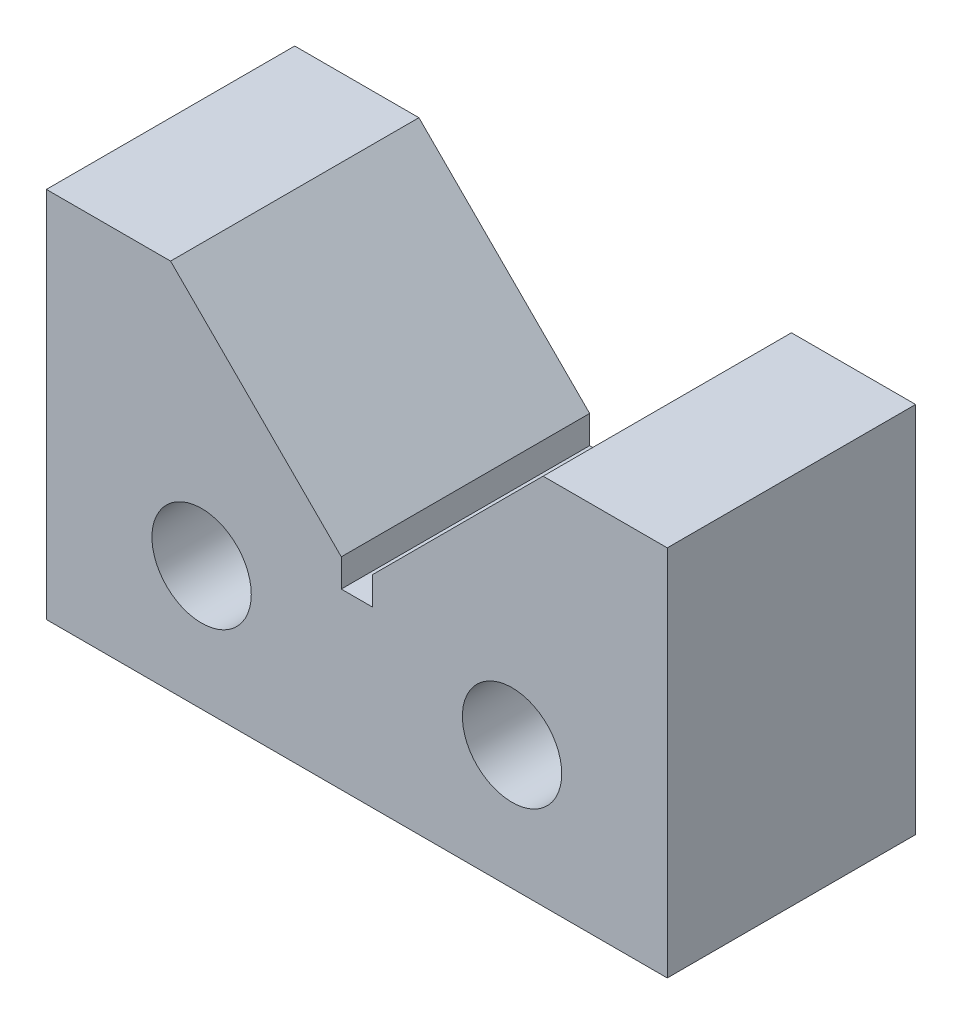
ISO-10303-21;
HEADER;
FILE_DESCRIPTION(('STEP AP214'),'2;1');
FILE_NAME('part.step','',(''),(''),'','','');
FILE_SCHEMA(('AUTOMOTIVE_DESIGN { 1 0 10303 214 1 1 1 1 }'));
ENDSEC;
DATA;
#1=APPLICATION_CONTEXT('core data for automotive mechanical design processes');
#2=APPLICATION_PROTOCOL_DEFINITION('international standard','automotive_design',2000,#1);
#3=PRODUCT_CONTEXT('',#1,'mechanical');
#4=PRODUCT('Part','Part','',(#3));
#5=PRODUCT_RELATED_PRODUCT_CATEGORY('part','',(#4));
#6=PRODUCT_DEFINITION_FORMATION('','',#4);
#7=PRODUCT_DEFINITION_CONTEXT('part definition',#1,'design');
#8=PRODUCT_DEFINITION('design','',#6,#7);
#9=PRODUCT_DEFINITION_SHAPE('','',#8);
#10=(LENGTH_UNIT() NAMED_UNIT(*) SI_UNIT(.MILLI.,.METRE.));
#11=(NAMED_UNIT(*) PLANE_ANGLE_UNIT() SI_UNIT($,.RADIAN.));
#12=(NAMED_UNIT(*) SI_UNIT($,.STERADIAN.) SOLID_ANGLE_UNIT());
#13=UNCERTAINTY_MEASURE_WITH_UNIT(LENGTH_MEASURE(1.E-05),#10,'distance_accuracy_value','');
#14=(GEOMETRIC_REPRESENTATION_CONTEXT(3) GLOBAL_UNCERTAINTY_ASSIGNED_CONTEXT((#13)) GLOBAL_UNIT_ASSIGNED_CONTEXT((#10,
#11,#12)) REPRESENTATION_CONTEXT('',''));
#15=CARTESIAN_POINT('',(0.,0.,0.));
#16=DIRECTION('',(0.,0.,1.));
#17=DIRECTION('',(1.,0.,0.));
#18=AXIS2_PLACEMENT_3D('',#15,#16,#17);
#19=CARTESIAN_POINT('',(-50.,60.,40.));
#20=DIRECTION('',(0.,-1.,0.));
#21=DIRECTION('',(0.,0.,-1.));
#22=AXIS2_PLACEMENT_3D('',#19,#20,#21);
#23=PLANE('',#22);
#24=DIRECTION('',(-1.,0.,0.));
#25=VECTOR('',#24,1.);
#26=CARTESIAN_POINT('',(-50.,60.,0.));
#27=LINE('',#26,#25);
#28=CARTESIAN_POINT('',(50.,60.,0.));
#29=VERTEX_POINT('',#28);
#30=CARTESIAN_POINT('',(30.,60.,0.));
#31=VERTEX_POINT('',#30);
#32=EDGE_CURVE('E171',#29,#31,#27,.T.);
#33=ORIENTED_EDGE('',*,*,#32,.T.);
#34=DIRECTION('',(0.,0.,1.));
#35=VECTOR('',#34,1.);
#36=CARTESIAN_POINT('',(30.,60.,0.));
#37=LINE('',#36,#35);
#38=CARTESIAN_POINT('',(30.,60.,40.));
#39=VERTEX_POINT('',#38);
#40=EDGE_CURVE('E160',#31,#39,#37,.T.);
#41=ORIENTED_EDGE('',*,*,#40,.T.);
#42=DIRECTION('',(-1.,0.,0.));
#43=VECTOR('',#42,1.);
#44=CARTESIAN_POINT('',(-50.,60.,40.));
#45=LINE('',#44,#43);
#46=CARTESIAN_POINT('',(50.,60.,40.));
#47=VERTEX_POINT('',#46);
#48=EDGE_CURVE('E175',#47,#39,#45,.T.);
#49=ORIENTED_EDGE('',*,*,#48,.F.);
#50=DIRECTION('',(0.,0.,-1.));
#51=VECTOR('',#50,1.);
#52=CARTESIAN_POINT('',(50.,60.,40.));
#53=LINE('',#52,#51);
#54=EDGE_CURVE('E188',#47,#29,#53,.T.);
#55=ORIENTED_EDGE('',*,*,#54,.T.);
#56=EDGE_LOOP('',(#33,#41,#49,#55));
#57=FACE_BOUND('',#56,.T.);
#58=ADVANCED_FACE('F31',(#57),#23,.F.);
#59=CARTESIAN_POINT('',(-50.,60.,40.));
#60=DIRECTION('',(1.,0.,0.));
#61=DIRECTION('',(0.,1.,0.));
#62=AXIS2_PLACEMENT_3D('',#59,#60,#61);
#63=PLANE('',#62);
#64=DIRECTION('',(0.,-1.,0.));
#65=VECTOR('',#64,1.);
#66=CARTESIAN_POINT('',(-50.,60.,0.));
#67=LINE('',#66,#65);
#68=CARTESIAN_POINT('',(-50.,60.,0.));
#69=VERTEX_POINT('',#68);
#70=CARTESIAN_POINT('',(-50.,0.,0.));
#71=VERTEX_POINT('',#70);
#72=EDGE_CURVE('E166',#69,#71,#67,.T.);
#73=ORIENTED_EDGE('',*,*,#72,.T.);
#74=DIRECTION('',(0.,0.,-1.));
#75=VECTOR('',#74,1.);
#76=CARTESIAN_POINT('',(-50.,0.,40.));
#77=LINE('',#76,#75);
#78=CARTESIAN_POINT('',(-50.,0.,40.));
#79=VERTEX_POINT('',#78);
#80=EDGE_CURVE('E11',#79,#71,#77,.T.);
#81=ORIENTED_EDGE('',*,*,#80,.F.);
#82=DIRECTION('',(0.,-1.,0.));
#83=VECTOR('',#82,1.);
#84=CARTESIAN_POINT('',(-50.,60.,40.));
#85=LINE('',#84,#83);
#86=CARTESIAN_POINT('',(-50.,60.,40.));
#87=VERTEX_POINT('',#86);
#88=EDGE_CURVE('E169',#87,#79,#85,.T.);
#89=ORIENTED_EDGE('',*,*,#88,.F.);
#90=DIRECTION('',(0.,0.,-1.));
#91=VECTOR('',#90,1.);
#92=CARTESIAN_POINT('',(-50.,60.,40.));
#93=LINE('',#92,#91);
#94=EDGE_CURVE('E178',#87,#69,#93,.T.);
#95=ORIENTED_EDGE('',*,*,#94,.T.);
#96=EDGE_LOOP('',(#73,#81,#89,#95));
#97=FACE_BOUND('',#96,.T.);
#98=ADVANCED_FACE('F33',(#97),#63,.F.);
#99=CARTESIAN_POINT('',(-50.,0.,40.));
#100=DIRECTION('',(0.,1.,0.));
#101=DIRECTION('',(0.,0.,1.));
#102=AXIS2_PLACEMENT_3D('',#99,#100,#101);
#103=PLANE('',#102);
#104=DIRECTION('',(1.,0.,0.));
#105=VECTOR('',#104,1.);
#106=CARTESIAN_POINT('',(-50.,0.,0.));
#107=LINE('',#106,#105);
#108=CARTESIAN_POINT('',(50.,0.,0.));
#109=VERTEX_POINT('',#108);
#110=EDGE_CURVE('E181',#71,#109,#107,.T.);
#111=ORIENTED_EDGE('',*,*,#110,.T.);
#112=DIRECTION('',(0.,0.,-1.));
#113=VECTOR('',#112,1.);
#114=CARTESIAN_POINT('',(50.,0.,40.));
#115=LINE('',#114,#113);
#116=CARTESIAN_POINT('',(50.,0.,40.));
#117=VERTEX_POINT('',#116);
#118=EDGE_CURVE('E39',#117,#109,#115,.T.);
#119=ORIENTED_EDGE('',*,*,#118,.F.);
#120=DIRECTION('',(1.,0.,0.));
#121=VECTOR('',#120,1.);
#122=CARTESIAN_POINT('',(-50.,0.,40.));
#123=LINE('',#122,#121);
#124=EDGE_CURVE('E84',#79,#117,#123,.T.);
#125=ORIENTED_EDGE('',*,*,#124,.F.);
#126=ORIENTED_EDGE('',*,*,#80,.T.);
#127=EDGE_LOOP('',(#111,#119,#125,#126));
#128=FACE_BOUND('',#127,.T.);
#129=ADVANCED_FACE('F208',(#128),#103,.F.);
#130=CARTESIAN_POINT('',(50.,60.,40.));
#131=DIRECTION('',(-1.,0.,0.));
#132=DIRECTION('',(0.,-1.,0.));
#133=AXIS2_PLACEMENT_3D('',#130,#131,#132);
#134=PLANE('',#133);
#135=DIRECTION('',(0.,1.,0.));
#136=VECTOR('',#135,1.);
#137=CARTESIAN_POINT('',(50.,60.,0.));
#138=LINE('',#137,#136);
#139=EDGE_CURVE('E183',#109,#29,#138,.T.);
#140=ORIENTED_EDGE('',*,*,#139,.T.);
#141=ORIENTED_EDGE('',*,*,#54,.F.);
#142=DIRECTION('',(0.,1.,0.));
#143=VECTOR('',#142,1.);
#144=CARTESIAN_POINT('',(50.,60.,40.));
#145=LINE('',#144,#143);
#146=EDGE_CURVE('E173',#117,#47,#145,.T.);
#147=ORIENTED_EDGE('',*,*,#146,.F.);
#148=ORIENTED_EDGE('',*,*,#118,.T.);
#149=EDGE_LOOP('',(#140,#141,#147,#148));
#150=FACE_BOUND('',#149,.T.);
#151=ADVANCED_FACE('F194',(#150),#134,.F.);
#152=CARTESIAN_POINT('',(-30.,60.,40.));
#153=VERTEX_POINT('',#152);
#154=EDGE_CURVE('E55',#153,#87,#45,.T.);
#155=ORIENTED_EDGE('',*,*,#154,.F.);
#156=DIRECTION('',(0.,0.,1.));
#157=VECTOR('',#156,1.);
#158=CARTESIAN_POINT('',(-30.,60.,0.));
#159=LINE('',#158,#157);
#160=CARTESIAN_POINT('',(-30.,60.,0.));
#161=VERTEX_POINT('',#160);
#162=EDGE_CURVE('E164',#161,#153,#159,.T.);
#163=ORIENTED_EDGE('',*,*,#162,.F.);
#164=EDGE_CURVE('E77',#161,#69,#27,.T.);
#165=ORIENTED_EDGE('',*,*,#164,.T.);
#166=ORIENTED_EDGE('',*,*,#94,.F.);
#167=EDGE_LOOP('',(#155,#163,#165,#166));
#168=FACE_BOUND('',#167,.T.);
#169=ADVANCED_FACE('F214',(#168),#23,.F.);
#170=CARTESIAN_POINT('',(-50.,0.,40.));
#171=DIRECTION('',(0.,0.,1.));
#172=DIRECTION('',(1.,0.,0.));
#173=AXIS2_PLACEMENT_3D('',#170,#171,#172);
#174=PLANE('',#173);
#175=CARTESIAN_POINT('',(25.,20.,40.));
#176=DIRECTION('',(0.,0.,1.));
#177=DIRECTION('',(1.,0.,0.));
#178=AXIS2_PLACEMENT_3D('',#175,#176,#177);
#179=CIRCLE('',#178,8.);
#180=CARTESIAN_POINT('',(33.,20.,40.));
#181=VERTEX_POINT('',#180);
#182=EDGE_CURVE('E263',#181,#181,#179,.T.);
#183=ORIENTED_EDGE('',*,*,#182,.F.);
#184=EDGE_LOOP('',(#183));
#185=FACE_BOUND('',#184,.T.);
#186=CARTESIAN_POINT('',(-25.,20.,40.));
#187=DIRECTION('',(0.,0.,1.));
#188=DIRECTION('',(1.,0.,0.));
#189=AXIS2_PLACEMENT_3D('',#186,#187,#188);
#190=CIRCLE('',#189,8.);
#191=CARTESIAN_POINT('',(-17.,20.,40.));
#192=VERTEX_POINT('',#191);
#193=EDGE_CURVE('E142',#192,#192,#190,.T.);
#194=ORIENTED_EDGE('',*,*,#193,.F.);
#195=EDGE_LOOP('',(#194));
#196=FACE_BOUND('',#195,.T.);
#197=DIRECTION('',(0.,-1.,0.));
#198=VECTOR('',#197,1.);
#199=CARTESIAN_POINT('',(-2.50000000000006,28.,40.));
#200=LINE('',#199,#198);
#201=CARTESIAN_POINT('',(-2.50000000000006,32.5000000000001,40.));
#202=VERTEX_POINT('',#201);
#203=CARTESIAN_POINT('',(-2.50000000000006,28.,40.));
#204=VERTEX_POINT('',#203);
#205=EDGE_CURVE('E120',#202,#204,#200,.T.);
#206=ORIENTED_EDGE('',*,*,#205,.F.);
#207=DIRECTION('',(0.707106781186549,-0.707106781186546,0.));
#208=VECTOR('',#207,1.);
#209=CARTESIAN_POINT('',(-30.,60.,40.));
#210=LINE('',#209,#208);
#211=EDGE_CURVE('E158',#153,#202,#210,.T.);
#212=ORIENTED_EDGE('',*,*,#211,.F.);
#213=ORIENTED_EDGE('',*,*,#154,.T.);
#214=ORIENTED_EDGE('',*,*,#88,.T.);
#215=ORIENTED_EDGE('',*,*,#124,.T.);
#216=ORIENTED_EDGE('',*,*,#146,.T.);
#217=ORIENTED_EDGE('',*,*,#48,.T.);
#218=DIRECTION('',(0.707106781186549,0.707106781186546,0.));
#219=VECTOR('',#218,1.);
#220=CARTESIAN_POINT('',(30.,60.,40.));
#221=LINE('',#220,#219);
#222=CARTESIAN_POINT('',(2.49999999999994,32.5000000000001,40.));
#223=VERTEX_POINT('',#222);
#224=EDGE_CURVE('E151',#223,#39,#221,.T.);
#225=ORIENTED_EDGE('',*,*,#224,.F.);
#226=DIRECTION('',(0.,1.,0.));
#227=VECTOR('',#226,1.);
#228=CARTESIAN_POINT('',(2.49999999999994,32.5000000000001,40.));
#229=LINE('',#228,#227);
#230=CARTESIAN_POINT('',(2.49999999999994,28.,40.));
#231=VERTEX_POINT('',#230);
#232=EDGE_CURVE('E137',#231,#223,#229,.T.);
#233=ORIENTED_EDGE('',*,*,#232,.F.);
#234=DIRECTION('',(1.,0.,0.));
#235=VECTOR('',#234,1.);
#236=CARTESIAN_POINT('',(2.49999999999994,28.,40.));
#237=LINE('',#236,#235);
#238=EDGE_CURVE('E139',#204,#231,#237,.T.);
#239=ORIENTED_EDGE('',*,*,#238,.F.);
#240=EDGE_LOOP('',(#206,#212,#213,#214,#215,#216,#217,#225,#233,#239));
#241=FACE_BOUND('',#240,.T.);
#242=ADVANCED_FACE('F203',(#185,#196,#241),#174,.T.);
#243=CARTESIAN_POINT('',(-50.,0.,0.));
#244=DIRECTION('',(0.,0.,1.));
#245=DIRECTION('',(1.,0.,0.));
#246=AXIS2_PLACEMENT_3D('',#243,#244,#245);
#247=PLANE('',#246);
#248=CARTESIAN_POINT('',(25.,20.,0.));
#249=DIRECTION('',(0.,0.,1.));
#250=DIRECTION('',(1.,0.,0.));
#251=AXIS2_PLACEMENT_3D('',#248,#249,#250);
#252=CIRCLE('',#251,8.);
#253=CARTESIAN_POINT('',(33.,20.,0.));
#254=VERTEX_POINT('',#253);
#255=EDGE_CURVE('E260',#254,#254,#252,.T.);
#256=ORIENTED_EDGE('',*,*,#255,.T.);
#257=EDGE_LOOP('',(#256));
#258=FACE_BOUND('',#257,.T.);
#259=CARTESIAN_POINT('',(-25.,20.,0.));
#260=DIRECTION('',(0.,0.,1.));
#261=DIRECTION('',(1.,0.,0.));
#262=AXIS2_PLACEMENT_3D('',#259,#260,#261);
#263=CIRCLE('',#262,8.);
#264=CARTESIAN_POINT('',(-17.,20.,0.));
#265=VERTEX_POINT('',#264);
#266=EDGE_CURVE('E147',#265,#265,#263,.T.);
#267=ORIENTED_EDGE('',*,*,#266,.T.);
#268=EDGE_LOOP('',(#267));
#269=FACE_BOUND('',#268,.T.);
#270=DIRECTION('',(0.707106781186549,-0.707106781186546,0.));
#271=VECTOR('',#270,1.);
#272=CARTESIAN_POINT('',(-30.,60.,0.));
#273=LINE('',#272,#271);
#274=CARTESIAN_POINT('',(-2.49999999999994,32.5000000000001,0.));
#275=VERTEX_POINT('',#274);
#276=EDGE_CURVE('E136',#161,#275,#273,.T.);
#277=ORIENTED_EDGE('',*,*,#276,.T.);
#278=DIRECTION('',(0.,-1.,0.));
#279=VECTOR('',#278,1.);
#280=CARTESIAN_POINT('',(-2.50000000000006,28.,0.));
#281=LINE('',#280,#279);
#282=CARTESIAN_POINT('',(-2.50000000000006,28.,0.));
#283=VERTEX_POINT('',#282);
#284=EDGE_CURVE('E46',#275,#283,#281,.T.);
#285=ORIENTED_EDGE('',*,*,#284,.T.);
#286=DIRECTION('',(1.,0.,0.));
#287=VECTOR('',#286,1.);
#288=CARTESIAN_POINT('',(2.49999999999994,28.,0.));
#289=LINE('',#288,#287);
#290=CARTESIAN_POINT('',(2.49999999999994,28.,0.));
#291=VERTEX_POINT('',#290);
#292=EDGE_CURVE('E128',#283,#291,#289,.T.);
#293=ORIENTED_EDGE('',*,*,#292,.T.);
#294=DIRECTION('',(0.,1.,0.));
#295=VECTOR('',#294,1.);
#296=CARTESIAN_POINT('',(2.49999999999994,32.5000000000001,0.));
#297=LINE('',#296,#295);
#298=CARTESIAN_POINT('',(2.49999999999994,32.5000000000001,0.));
#299=VERTEX_POINT('',#298);
#300=EDGE_CURVE('E125',#291,#299,#297,.T.);
#301=ORIENTED_EDGE('',*,*,#300,.T.);
#302=DIRECTION('',(0.707106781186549,0.707106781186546,0.));
#303=VECTOR('',#302,1.);
#304=CARTESIAN_POINT('',(30.,60.,0.));
#305=LINE('',#304,#303);
#306=EDGE_CURVE('E156',#299,#31,#305,.T.);
#307=ORIENTED_EDGE('',*,*,#306,.T.);
#308=ORIENTED_EDGE('',*,*,#32,.F.);
#309=ORIENTED_EDGE('',*,*,#139,.F.);
#310=ORIENTED_EDGE('',*,*,#110,.F.);
#311=ORIENTED_EDGE('',*,*,#72,.F.);
#312=ORIENTED_EDGE('',*,*,#164,.F.);
#313=EDGE_LOOP('',(#277,#285,#293,#301,#307,#308,#309,#310,#311,#312));
#314=FACE_BOUND('',#313,.T.);
#315=ADVANCED_FACE('F135',(#258,#269,#314),#247,.F.);
#316=CARTESIAN_POINT('',(30.,60.,0.));
#317=DIRECTION('',(0.707106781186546,-0.707106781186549,0.));
#318=DIRECTION('',(0.707106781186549,0.707106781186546,0.));
#319=AXIS2_PLACEMENT_3D('',#316,#317,#318);
#320=PLANE('',#319);
#321=ORIENTED_EDGE('',*,*,#306,.F.);
#322=DIRECTION('',(0.,0.,1.));
#323=VECTOR('',#322,1.);
#324=CARTESIAN_POINT('',(2.49999999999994,32.5000000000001,0.));
#325=LINE('',#324,#323);
#326=EDGE_CURVE('E152',#299,#223,#325,.T.);
#327=ORIENTED_EDGE('',*,*,#326,.T.);
#328=ORIENTED_EDGE('',*,*,#224,.T.);
#329=ORIENTED_EDGE('',*,*,#40,.F.);
#330=EDGE_LOOP('',(#321,#327,#328,#329));
#331=FACE_BOUND('',#330,.T.);
#332=ADVANCED_FACE('F232',(#331),#320,.F.);
#333=CARTESIAN_POINT('',(-30.,60.,0.));
#334=DIRECTION('',(-0.707106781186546,-0.707106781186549,0.));
#335=DIRECTION('',(0.707106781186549,-0.707106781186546,0.));
#336=AXIS2_PLACEMENT_3D('',#333,#334,#335);
#337=PLANE('',#336);
#338=ORIENTED_EDGE('',*,*,#211,.T.);
#339=DIRECTION('',(0.,0.,1.));
#340=VECTOR('',#339,1.);
#341=CARTESIAN_POINT('',(-2.50000000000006,32.5000000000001,0.));
#342=LINE('',#341,#340);
#343=EDGE_CURVE('E149',#275,#202,#342,.T.);
#344=ORIENTED_EDGE('',*,*,#343,.F.);
#345=ORIENTED_EDGE('',*,*,#276,.F.);
#346=ORIENTED_EDGE('',*,*,#162,.T.);
#347=EDGE_LOOP('',(#338,#344,#345,#346));
#348=FACE_BOUND('',#347,.T.);
#349=ADVANCED_FACE('F228',(#348),#337,.F.);
#350=CARTESIAN_POINT('',(-2.50000000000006,28.,0.));
#351=DIRECTION('',(-1.,0.,0.));
#352=DIRECTION('',(0.,0.,1.));
#353=AXIS2_PLACEMENT_3D('',#350,#351,#352);
#354=PLANE('',#353);
#355=ORIENTED_EDGE('',*,*,#205,.T.);
#356=DIRECTION('',(0.,0.,1.));
#357=VECTOR('',#356,1.);
#358=CARTESIAN_POINT('',(-2.50000000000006,28.,0.));
#359=LINE('',#358,#357);
#360=EDGE_CURVE('E116',#283,#204,#359,.T.);
#361=ORIENTED_EDGE('',*,*,#360,.F.);
#362=ORIENTED_EDGE('',*,*,#284,.F.);
#363=ORIENTED_EDGE('',*,*,#343,.T.);
#364=EDGE_LOOP('',(#355,#361,#362,#363));
#365=FACE_BOUND('',#364,.T.);
#366=ADVANCED_FACE('F118',(#365),#354,.F.);
#367=CARTESIAN_POINT('',(2.49999999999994,32.5000000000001,0.));
#368=DIRECTION('',(1.,0.,0.));
#369=DIRECTION('',(0.,1.,0.));
#370=AXIS2_PLACEMENT_3D('',#367,#368,#369);
#371=PLANE('',#370);
#372=ORIENTED_EDGE('',*,*,#232,.T.);
#373=ORIENTED_EDGE('',*,*,#326,.F.);
#374=ORIENTED_EDGE('',*,*,#300,.F.);
#375=DIRECTION('',(0.,0.,1.));
#376=VECTOR('',#375,1.);
#377=CARTESIAN_POINT('',(2.49999999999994,28.,0.));
#378=LINE('',#377,#376);
#379=EDGE_CURVE('E124',#291,#231,#378,.T.);
#380=ORIENTED_EDGE('',*,*,#379,.T.);
#381=EDGE_LOOP('',(#372,#373,#374,#380));
#382=FACE_BOUND('',#381,.T.);
#383=ADVANCED_FACE('F230',(#382),#371,.F.);
#384=CARTESIAN_POINT('',(2.49999999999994,28.,0.));
#385=DIRECTION('',(0.,-1.,0.));
#386=DIRECTION('',(0.,0.,-1.));
#387=AXIS2_PLACEMENT_3D('',#384,#385,#386);
#388=PLANE('',#387);
#389=ORIENTED_EDGE('',*,*,#238,.T.);
#390=ORIENTED_EDGE('',*,*,#379,.F.);
#391=ORIENTED_EDGE('',*,*,#292,.F.);
#392=ORIENTED_EDGE('',*,*,#360,.T.);
#393=EDGE_LOOP('',(#389,#390,#391,#392));
#394=FACE_BOUND('',#393,.T.);
#395=ADVANCED_FACE('F129',(#394),#388,.F.);
#396=CARTESIAN_POINT('',(-25.,20.,0.));
#397=DIRECTION('',(0.,0.,1.));
#398=DIRECTION('',(1.,0.,0.));
#399=AXIS2_PLACEMENT_3D('',#396,#397,#398);
#400=CYLINDRICAL_SURFACE('',#399,8.);
#401=ORIENTED_EDGE('',*,*,#266,.F.);
#402=EDGE_LOOP('',(#401));
#403=FACE_BOUND('',#402,.T.);
#404=ORIENTED_EDGE('',*,*,#193,.T.);
#405=EDGE_LOOP('',(#404));
#406=FACE_BOUND('',#405,.T.);
#407=ADVANCED_FACE('F246',(#403,#406),#400,.F.);
#408=CARTESIAN_POINT('',(25.,20.,0.));
#409=DIRECTION('',(0.,0.,1.));
#410=DIRECTION('',(1.,0.,0.));
#411=AXIS2_PLACEMENT_3D('',#408,#409,#410);
#412=CYLINDRICAL_SURFACE('',#411,8.);
#413=ORIENTED_EDGE('',*,*,#255,.F.);
#414=EDGE_LOOP('',(#413));
#415=FACE_BOUND('',#414,.T.);
#416=ORIENTED_EDGE('',*,*,#182,.T.);
#417=EDGE_LOOP('',(#416));
#418=FACE_BOUND('',#417,.T.);
#419=ADVANCED_FACE('F251',(#415,#418),#412,.F.);
#420=CLOSED_SHELL('',(#58,#98,#129,#151,#169,#242,#315,#332,#349,#366,#383,#395,#407,#419));
#421=MANIFOLD_SOLID_BREP('B2',#420);
#422=ADVANCED_BREP_SHAPE_REPRESENTATION('',(#18,#421),#14);
#423=SHAPE_DEFINITION_REPRESENTATION(#9,#422);
ENDSEC;
END-ISO-10303-21;
